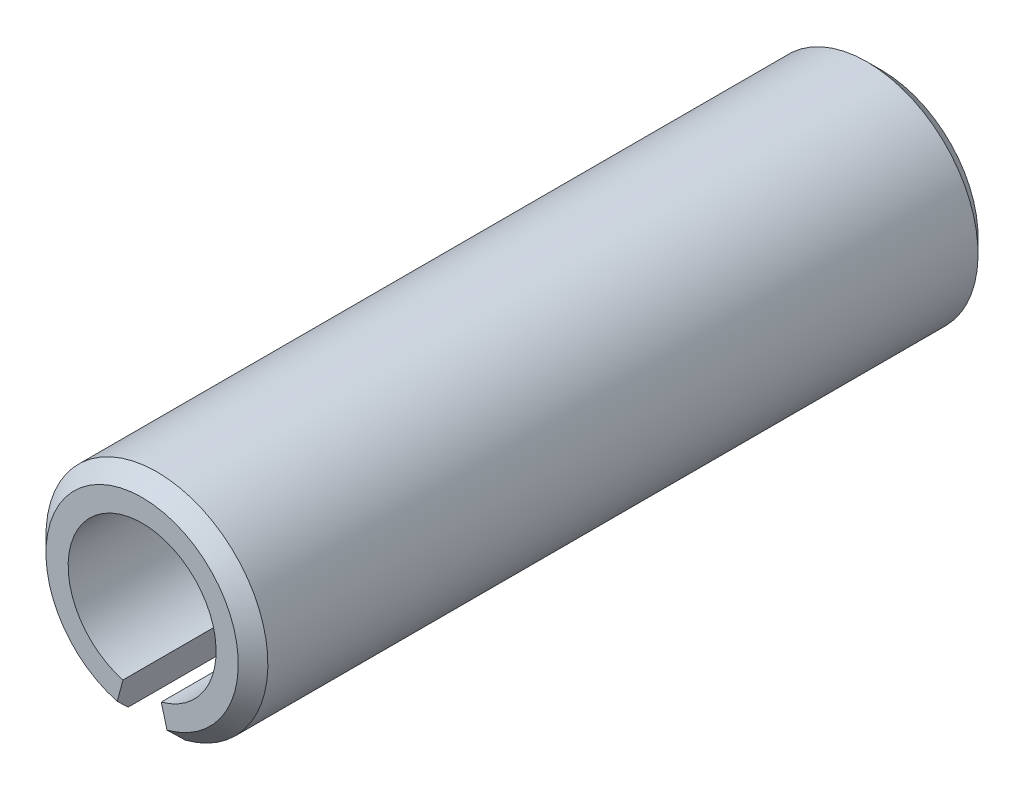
ISO-10303-21;
HEADER;
FILE_DESCRIPTION(('STEP AP214'),'2;1');
FILE_NAME('part.step','',(''),(''),'','','');
FILE_SCHEMA(('AUTOMOTIVE_DESIGN { 1 0 10303 214 1 1 1 1 }'));
ENDSEC;
DATA;
#1=APPLICATION_CONTEXT('core data for automotive mechanical design processes');
#2=APPLICATION_PROTOCOL_DEFINITION('international standard','automotive_design',2000,#1);
#3=PRODUCT_CONTEXT('',#1,'mechanical');
#4=PRODUCT('Part','Part','',(#3));
#5=PRODUCT_RELATED_PRODUCT_CATEGORY('part','',(#4));
#6=PRODUCT_DEFINITION_FORMATION('','',#4);
#7=PRODUCT_DEFINITION_CONTEXT('part definition',#1,'design');
#8=PRODUCT_DEFINITION('design','',#6,#7);
#9=PRODUCT_DEFINITION_SHAPE('','',#8);
#10=(LENGTH_UNIT() NAMED_UNIT(*) SI_UNIT(.MILLI.,.METRE.));
#11=(NAMED_UNIT(*) PLANE_ANGLE_UNIT() SI_UNIT($,.RADIAN.));
#12=(NAMED_UNIT(*) SI_UNIT($,.STERADIAN.) SOLID_ANGLE_UNIT());
#13=UNCERTAINTY_MEASURE_WITH_UNIT(LENGTH_MEASURE(1.E-05),#10,'distance_accuracy_value','');
#14=(GEOMETRIC_REPRESENTATION_CONTEXT(3) GLOBAL_UNCERTAINTY_ASSIGNED_CONTEXT((#13)) GLOBAL_UNIT_ASSIGNED_CONTEXT((#10,
#11,#12)) REPRESENTATION_CONTEXT('',''));
#15=CARTESIAN_POINT('',(0.,0.,0.));
#16=DIRECTION('',(0.,0.,1.));
#17=DIRECTION('',(1.,0.,0.));
#18=AXIS2_PLACEMENT_3D('',#15,#16,#17);
#19=CARTESIAN_POINT('',(0.,0.,9.99999999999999));
#20=DIRECTION('',(0.,0.,-1.));
#21=DIRECTION('',(-1.,0.,0.));
#22=AXIS2_PLACEMENT_3D('',#19,#20,#21);
#23=CYLINDRICAL_SURFACE('',#22,1.5);
#24=DIRECTION('',(0.,0.,-1.));
#25=VECTOR('',#24,1.);
#26=CARTESIAN_POINT('',(-0.388228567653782,-1.4488887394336,9.99999999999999));
#27=LINE('',#26,#25);
#28=CARTESIAN_POINT('',(-0.388228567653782,-1.4488887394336,9.8));
#29=VERTEX_POINT('',#28);
#30=CARTESIAN_POINT('',(-0.388228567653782,-1.4488887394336,0.200000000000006));
#31=VERTEX_POINT('',#30);
#32=EDGE_CURVE('E426',#29,#31,#27,.T.);
#33=ORIENTED_EDGE('',*,*,#32,.F.);
#34=CARTESIAN_POINT('',(0.,0.,9.8));
#35=DIRECTION('',(0.,0.,1.));
#36=DIRECTION('',(1.,0.,0.));
#37=AXIS2_PLACEMENT_3D('',#34,#35,#36);
#38=CIRCLE('',#37,1.5);
#39=CARTESIAN_POINT('',(0.388228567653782,-1.4488887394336,9.8));
#40=VERTEX_POINT('',#39);
#41=EDGE_CURVE('E453',#29,#40,#38,.F.);
#42=ORIENTED_EDGE('',*,*,#41,.T.);
#43=DIRECTION('',(0.,0.,-1.));
#44=VECTOR('',#43,1.);
#45=CARTESIAN_POINT('',(0.388228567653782,-1.4488887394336,9.99999999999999));
#46=LINE('',#45,#44);
#47=CARTESIAN_POINT('',(0.388228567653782,-1.4488887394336,0.200000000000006));
#48=VERTEX_POINT('',#47);
#49=EDGE_CURVE('E440',#40,#48,#46,.T.);
#50=ORIENTED_EDGE('',*,*,#49,.T.);
#51=CARTESIAN_POINT('',(0.,0.,0.200000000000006));
#52=DIRECTION('',(0.,0.,1.));
#53=DIRECTION('',(1.,0.,0.));
#54=AXIS2_PLACEMENT_3D('',#51,#52,#53);
#55=CIRCLE('',#54,1.5);
#56=EDGE_CURVE('E450',#48,#31,#55,.T.);
#57=ORIENTED_EDGE('',*,*,#56,.T.);
#58=EDGE_LOOP('',(#33,#42,#50,#57));
#59=FACE_BOUND('',#58,.T.);
#60=ADVANCED_FACE('F358',(#59),#23,.T.);
#61=CARTESIAN_POINT('',(-0.258819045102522,-0.965925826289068,9.99999999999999));
#62=DIRECTION('',(-0.965925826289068,0.258819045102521,0.));
#63=DIRECTION('',(-0.258819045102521,-0.965925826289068,0.));
#64=AXIS2_PLACEMENT_3D('',#61,#62,#63);
#65=PLANE('',#64);
#66=DIRECTION('',(0.258819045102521,0.965925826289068,0.));
#67=VECTOR('',#66,1.);
#68=CARTESIAN_POINT('',(-0.258819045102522,-0.965925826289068,9.99999999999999));
#69=LINE('',#68,#67);
#70=CARTESIAN_POINT('',(-0.336464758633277,-1.25570357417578,9.99999999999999));
#71=VERTEX_POINT('',#70);
#72=CARTESIAN_POINT('',(-0.258819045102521,-0.965925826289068,9.99999999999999));
#73=VERTEX_POINT('',#72);
#74=EDGE_CURVE('E432',#71,#73,#69,.T.);
#75=ORIENTED_EDGE('',*,*,#74,.F.);
#76=DIRECTION('',(0.18301270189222,0.683012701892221,0.707106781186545));
#77=VECTOR('',#76,1.);
#78=CARTESIAN_POINT('',(0.,0.,11.3));
#79=LINE('',#78,#77);
#80=EDGE_CURVE('E448',#71,#29,#79,.F.);
#81=ORIENTED_EDGE('',*,*,#80,.T.);
#82=ORIENTED_EDGE('',*,*,#32,.T.);
#83=DIRECTION('',(-0.183012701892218,-0.683012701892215,0.707106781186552));
#84=VECTOR('',#83,1.);
#85=CARTESIAN_POINT('',(0.,0.,-1.30000000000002));
#86=LINE('',#85,#84);
#87=CARTESIAN_POINT('',(-0.336464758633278,-1.25570357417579,0.));
#88=VERTEX_POINT('',#87);
#89=EDGE_CURVE('E417',#31,#88,#86,.F.);
#90=ORIENTED_EDGE('',*,*,#89,.T.);
#91=DIRECTION('',(0.258819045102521,0.965925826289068,0.));
#92=VECTOR('',#91,1.);
#93=CARTESIAN_POINT('',(-0.258819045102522,-0.965925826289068,0.));
#94=LINE('',#93,#92);
#95=CARTESIAN_POINT('',(-0.258819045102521,-0.965925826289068,0.));
#96=VERTEX_POINT('',#95);
#97=EDGE_CURVE('E410',#88,#96,#94,.T.);
#98=ORIENTED_EDGE('',*,*,#97,.T.);
#99=DIRECTION('',(0.,0.,-1.));
#100=VECTOR('',#99,1.);
#101=CARTESIAN_POINT('',(-0.258819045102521,-0.965925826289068,9.99999999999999));
#102=LINE('',#101,#100);
#103=EDGE_CURVE('E414',#73,#96,#102,.T.);
#104=ORIENTED_EDGE('',*,*,#103,.F.);
#105=EDGE_LOOP('',(#75,#81,#82,#90,#98,#104));
#106=FACE_BOUND('',#105,.T.);
#107=ADVANCED_FACE('F413',(#106),#65,.F.);
#108=CARTESIAN_POINT('',(0.,0.,9.99999999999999));
#109=DIRECTION('',(0.,0.,-1.));
#110=DIRECTION('',(-1.,0.,0.));
#111=AXIS2_PLACEMENT_3D('',#108,#109,#110);
#112=CYLINDRICAL_SURFACE('',#111,1.);
#113=CARTESIAN_POINT('',(0.,0.,0.));
#114=DIRECTION('',(0.,0.,-1.));
#115=DIRECTION('',(1.,0.,0.));
#116=AXIS2_PLACEMENT_3D('',#113,#114,#115);
#117=CIRCLE('',#116,1.);
#118=CARTESIAN_POINT('',(0.258819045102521,-0.965925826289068,0.));
#119=VERTEX_POINT('',#118);
#120=EDGE_CURVE('E419',#96,#119,#117,.T.);
#121=ORIENTED_EDGE('',*,*,#120,.T.);
#122=DIRECTION('',(0.,0.,-1.));
#123=VECTOR('',#122,1.);
#124=CARTESIAN_POINT('',(0.258819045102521,-0.965925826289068,9.99999999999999));
#125=LINE('',#124,#123);
#126=CARTESIAN_POINT('',(0.258819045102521,-0.965925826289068,9.99999999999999));
#127=VERTEX_POINT('',#126);
#128=EDGE_CURVE('E427',#127,#119,#125,.T.);
#129=ORIENTED_EDGE('',*,*,#128,.F.);
#130=CARTESIAN_POINT('',(0.,0.,9.99999999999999));
#131=DIRECTION('',(0.,0.,-1.));
#132=DIRECTION('',(1.,0.,0.));
#133=AXIS2_PLACEMENT_3D('',#130,#131,#132);
#134=CIRCLE('',#133,1.);
#135=EDGE_CURVE('E425',#73,#127,#134,.T.);
#136=ORIENTED_EDGE('',*,*,#135,.F.);
#137=ORIENTED_EDGE('',*,*,#103,.T.);
#138=EDGE_LOOP('',(#121,#129,#136,#137));
#139=FACE_BOUND('',#138,.T.);
#140=ADVANCED_FACE('F422',(#139),#112,.F.);
#141=CARTESIAN_POINT('',(0.258819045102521,-0.965925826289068,9.99999999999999));
#142=DIRECTION('',(0.965925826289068,0.258819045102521,0.));
#143=DIRECTION('',(-0.258819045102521,0.965925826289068,0.));
#144=AXIS2_PLACEMENT_3D('',#141,#142,#143);
#145=PLANE('',#144);
#146=ORIENTED_EDGE('',*,*,#49,.F.);
#147=DIRECTION('',(0.18301270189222,-0.683012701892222,-0.707106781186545));
#148=VECTOR('',#147,1.);
#149=CARTESIAN_POINT('',(0.,0.,11.3));
#150=LINE('',#149,#148);
#151=CARTESIAN_POINT('',(0.336464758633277,-1.25570357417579,9.99999999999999));
#152=VERTEX_POINT('',#151);
#153=EDGE_CURVE('E365',#40,#152,#150,.F.);
#154=ORIENTED_EDGE('',*,*,#153,.T.);
#155=DIRECTION('',(0.258819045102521,-0.965925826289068,0.));
#156=VECTOR('',#155,1.);
#157=CARTESIAN_POINT('',(0.258819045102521,-0.965925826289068,9.99999999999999));
#158=LINE('',#157,#156);
#159=EDGE_CURVE('E437',#127,#152,#158,.T.);
#160=ORIENTED_EDGE('',*,*,#159,.F.);
#161=ORIENTED_EDGE('',*,*,#128,.T.);
#162=DIRECTION('',(0.258819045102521,-0.965925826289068,0.));
#163=VECTOR('',#162,1.);
#164=CARTESIAN_POINT('',(0.258819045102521,-0.965925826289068,0.));
#165=LINE('',#164,#163);
#166=CARTESIAN_POINT('',(0.336464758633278,-1.25570357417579,0.));
#167=VERTEX_POINT('',#166);
#168=EDGE_CURVE('E430',#119,#167,#165,.T.);
#169=ORIENTED_EDGE('',*,*,#168,.T.);
#170=DIRECTION('',(-0.183012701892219,0.683012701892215,-0.707106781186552));
#171=VECTOR('',#170,1.);
#172=CARTESIAN_POINT('',(0.,0.,-1.30000000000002));
#173=LINE('',#172,#171);
#174=EDGE_CURVE('E377',#167,#48,#173,.F.);
#175=ORIENTED_EDGE('',*,*,#174,.T.);
#176=EDGE_LOOP('',(#146,#154,#160,#161,#169,#175));
#177=FACE_BOUND('',#176,.T.);
#178=ADVANCED_FACE('F457',(#177),#145,.F.);
#179=CARTESIAN_POINT('',(0.,0.,9.99999999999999));
#180=DIRECTION('',(0.,0.,1.));
#181=DIRECTION('',(1.,0.,0.));
#182=AXIS2_PLACEMENT_3D('',#179,#180,#181);
#183=PLANE('',#182);
#184=ORIENTED_EDGE('',*,*,#159,.T.);
#185=CARTESIAN_POINT('',(0.,0.,9.99999999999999));
#186=DIRECTION('',(0.,0.,1.));
#187=DIRECTION('',(1.,0.,0.));
#188=AXIS2_PLACEMENT_3D('',#185,#186,#187);
#189=CIRCLE('',#188,1.3);
#190=EDGE_CURVE('E444',#152,#71,#189,.T.);
#191=ORIENTED_EDGE('',*,*,#190,.T.);
#192=ORIENTED_EDGE('',*,*,#74,.T.);
#193=ORIENTED_EDGE('',*,*,#135,.T.);
#194=EDGE_LOOP('',(#184,#191,#192,#193));
#195=FACE_BOUND('',#194,.T.);
#196=ADVANCED_FACE('F462',(#195),#183,.T.);
#197=CARTESIAN_POINT('',(0.,0.,0.));
#198=DIRECTION('',(0.,0.,1.));
#199=DIRECTION('',(1.,0.,0.));
#200=AXIS2_PLACEMENT_3D('',#197,#198,#199);
#201=PLANE('',#200);
#202=ORIENTED_EDGE('',*,*,#97,.F.);
#203=CARTESIAN_POINT('',(0.,0.,0.));
#204=DIRECTION('',(0.,0.,1.));
#205=DIRECTION('',(1.,0.,0.));
#206=AXIS2_PLACEMENT_3D('',#203,#204,#205);
#207=CIRCLE('',#206,1.3);
#208=EDGE_CURVE('E13',#88,#167,#207,.F.);
#209=ORIENTED_EDGE('',*,*,#208,.T.);
#210=ORIENTED_EDGE('',*,*,#168,.F.);
#211=ORIENTED_EDGE('',*,*,#120,.F.);
#212=EDGE_LOOP('',(#202,#209,#210,#211));
#213=FACE_BOUND('',#212,.T.);
#214=ADVANCED_FACE('F429',(#213),#201,.F.);
#215=CARTESIAN_POINT('',(0.,0.,9.99999999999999));
#216=DIRECTION('',(0.,0.,-1.));
#217=DIRECTION('',(-1.,0.,0.));
#218=AXIS2_PLACEMENT_3D('',#215,#216,#217);
#219=CONICAL_SURFACE('',#218,1.3,0.785398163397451);
#220=ORIENTED_EDGE('',*,*,#153,.F.);
#221=ORIENTED_EDGE('',*,*,#41,.F.);
#222=ORIENTED_EDGE('',*,*,#80,.F.);
#223=ORIENTED_EDGE('',*,*,#190,.F.);
#224=EDGE_LOOP('',(#220,#221,#222,#223));
#225=FACE_BOUND('',#224,.T.);
#226=ADVANCED_FACE('F463',(#225),#219,.T.);
#227=CARTESIAN_POINT('',(0.,0.,0.200000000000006));
#228=DIRECTION('',(0.,0.,1.));
#229=DIRECTION('',(1.,0.,0.));
#230=AXIS2_PLACEMENT_3D('',#227,#228,#229);
#231=CONICAL_SURFACE('',#230,1.5,0.785398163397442);
#232=ORIENTED_EDGE('',*,*,#174,.F.);
#233=ORIENTED_EDGE('',*,*,#208,.F.);
#234=ORIENTED_EDGE('',*,*,#89,.F.);
#235=ORIENTED_EDGE('',*,*,#56,.F.);
#236=EDGE_LOOP('',(#232,#233,#234,#235));
#237=FACE_BOUND('',#236,.T.);
#238=ADVANCED_FACE('F468',(#237),#231,.T.);
#239=CLOSED_SHELL('',(#60,#107,#140,#178,#196,#214,#226,#238));
#240=MANIFOLD_SOLID_BREP('B2',#239);
#241=ADVANCED_BREP_SHAPE_REPRESENTATION('',(#18,#240),#14);
#242=SHAPE_DEFINITION_REPRESENTATION(#9,#241);
ENDSEC;
END-ISO-10303-21;
